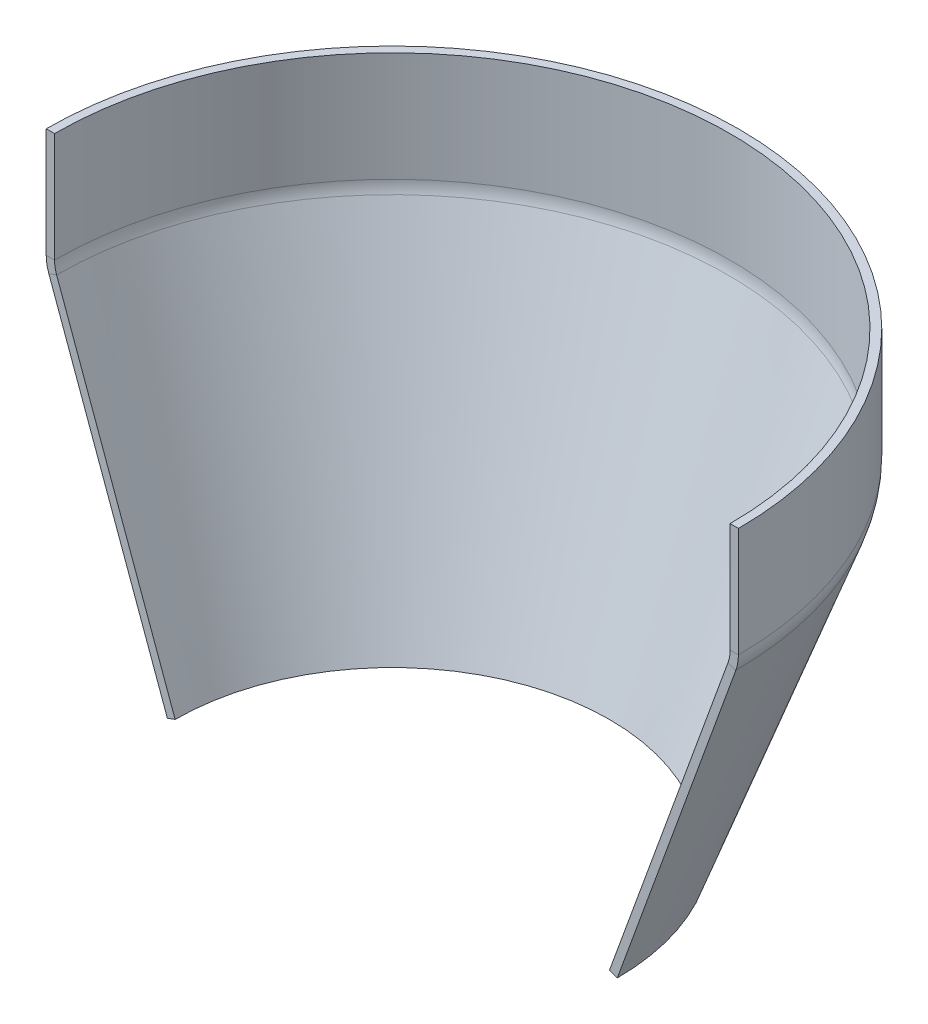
ISO-10303-21;
HEADER;
FILE_DESCRIPTION(('STEP AP214'),'2;1');
FILE_NAME('part.step','',(''),(''),'','','');
FILE_SCHEMA(('AUTOMOTIVE_DESIGN { 1 0 10303 214 1 1 1 1 }'));
ENDSEC;
DATA;
#1=APPLICATION_CONTEXT('core data for automotive mechanical design processes');
#2=APPLICATION_PROTOCOL_DEFINITION('international standard','automotive_design',2000,#1);
#3=PRODUCT_CONTEXT('',#1,'mechanical');
#4=PRODUCT('Part','Part','',(#3));
#5=PRODUCT_RELATED_PRODUCT_CATEGORY('part','',(#4));
#6=PRODUCT_DEFINITION_FORMATION('','',#4);
#7=PRODUCT_DEFINITION_CONTEXT('part definition',#1,'design');
#8=PRODUCT_DEFINITION('design','',#6,#7);
#9=PRODUCT_DEFINITION_SHAPE('','',#8);
#10=(LENGTH_UNIT() NAMED_UNIT(*) SI_UNIT(.MILLI.,.METRE.));
#11=(NAMED_UNIT(*) PLANE_ANGLE_UNIT() SI_UNIT($,.RADIAN.));
#12=(NAMED_UNIT(*) SI_UNIT($,.STERADIAN.) SOLID_ANGLE_UNIT());
#13=UNCERTAINTY_MEASURE_WITH_UNIT(LENGTH_MEASURE(1.E-05),#10,'distance_accuracy_value','');
#14=(GEOMETRIC_REPRESENTATION_CONTEXT(3) GLOBAL_UNCERTAINTY_ASSIGNED_CONTEXT((#13)) GLOBAL_UNIT_ASSIGNED_CONTEXT((#10,
#11,#12)) REPRESENTATION_CONTEXT('',''));
#15=CARTESIAN_POINT('',(0.,0.,0.));
#16=DIRECTION('',(0.,0.,1.));
#17=DIRECTION('',(1.,0.,0.));
#18=AXIS2_PLACEMENT_3D('',#15,#16,#17);
#19=CARTESIAN_POINT('',(-43.8,49.1740821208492,0.));
#20=DIRECTION('',(0.,0.,-1.));
#21=DIRECTION('',(-1.,0.,0.));
#22=AXIS2_PLACEMENT_3D('',#19,#20,#21);
#23=PLANE('',#22);
#24=DIRECTION('',(1.,0.,0.));
#25=VECTOR('',#24,1.);
#26=CARTESIAN_POINT('',(-50.,49.1740821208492,0.));
#27=LINE('',#26,#25);
#28=CARTESIAN_POINT('',(-50.,49.1740821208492,0.));
#29=VERTEX_POINT('',#28);
#30=CARTESIAN_POINT('',(-48.8,49.1740821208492,0.));
#31=VERTEX_POINT('',#30);
#32=EDGE_CURVE('E11',#29,#31,#27,.T.);
#33=ORIENTED_EDGE('',*,*,#32,.F.);
#34=CARTESIAN_POINT('',(-43.8,49.1740821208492,0.));
#35=DIRECTION('',(0.,0.,1.));
#36=DIRECTION('',(1.,0.,0.));
#37=AXIS2_PLACEMENT_3D('',#34,#35,#36);
#38=CIRCLE('',#37,6.2);
#39=CARTESIAN_POINT('',(-49.6260942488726,47.0535572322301,0.));
#40=VERTEX_POINT('',#39);
#41=EDGE_CURVE('E135',#40,#29,#38,.F.);
#42=ORIENTED_EDGE('',*,*,#41,.F.);
#43=DIRECTION('',(0.939692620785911,0.342020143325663,0.));
#44=VECTOR('',#43,1.);
#45=CARTESIAN_POINT('',(-49.6260942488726,47.0535572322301,0.));
#46=LINE('',#45,#44);
#47=CARTESIAN_POINT('',(-48.4984631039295,47.4639814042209,0.));
#48=VERTEX_POINT('',#47);
#49=EDGE_CURVE('E48',#40,#48,#46,.T.);
#50=ORIENTED_EDGE('',*,*,#49,.T.);
#51=CARTESIAN_POINT('',(-43.8,49.1740821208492,0.));
#52=DIRECTION('',(0.,0.,-1.));
#53=DIRECTION('',(-1.,0.,0.));
#54=AXIS2_PLACEMENT_3D('',#51,#52,#53);
#55=CIRCLE('',#54,5.);
#56=EDGE_CURVE('E132',#48,#31,#55,.T.);
#57=ORIENTED_EDGE('',*,*,#56,.T.);
#58=EDGE_LOOP('',(#33,#42,#50,#57));
#59=FACE_BOUND('',#58,.T.);
#60=ADVANCED_FACE('F38',(#59),#23,.F.);
#61=CARTESIAN_POINT('',(-32.5,0.,0.));
#62=DIRECTION('',(0.,0.,1.));
#63=DIRECTION('',(-0.342020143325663,0.93969262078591,0.));
#64=AXIS2_PLACEMENT_3D('',#61,#62,#63);
#65=PLANE('',#64);
#66=ORIENTED_EDGE('',*,*,#49,.F.);
#67=DIRECTION('',(-0.342020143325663,0.93969262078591,0.));
#68=VECTOR('',#67,1.);
#69=CARTESIAN_POINT('',(-32.5,0.,0.));
#70=LINE('',#69,#68);
#71=CARTESIAN_POINT('',(-32.5,0.,0.));
#72=VERTEX_POINT('',#71);
#73=EDGE_CURVE('E175',#72,#40,#70,.T.);
#74=ORIENTED_EDGE('',*,*,#73,.F.);
#75=DIRECTION('',(0.939692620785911,0.342020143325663,0.));
#76=VECTOR('',#75,1.);
#77=CARTESIAN_POINT('',(-32.5,0.,0.));
#78=LINE('',#77,#76);
#79=CARTESIAN_POINT('',(-31.3723688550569,0.410424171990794,0.));
#80=VERTEX_POINT('',#79);
#81=EDGE_CURVE('E124',#72,#80,#78,.T.);
#82=ORIENTED_EDGE('',*,*,#81,.T.);
#83=DIRECTION('',(-0.342020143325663,0.939692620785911,0.));
#84=VECTOR('',#83,1.);
#85=CARTESIAN_POINT('',(-31.3723688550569,0.410424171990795,0.));
#86=LINE('',#85,#84);
#87=EDGE_CURVE('E152',#80,#48,#86,.T.);
#88=ORIENTED_EDGE('',*,*,#87,.T.);
#89=EDGE_LOOP('',(#66,#74,#82,#88));
#90=FACE_BOUND('',#89,.T.);
#91=ADVANCED_FACE('F153',(#90),#65,.T.);
#92=CARTESIAN_POINT('',(0.,0.,0.));
#93=DIRECTION('',(0.,-1.,0.));
#94=DIRECTION('',(0.,0.,-1.));
#95=AXIS2_PLACEMENT_3D('',#92,#93,#94);
#96=CONICAL_SURFACE('',#95,32.5,1.22173047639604);
#97=ORIENTED_EDGE('',*,*,#81,.F.);
#98=CARTESIAN_POINT('',(0.,0.,0.));
#99=DIRECTION('',(0.,1.,0.));
#100=DIRECTION('',(1.,0.,0.));
#101=AXIS2_PLACEMENT_3D('',#98,#99,#100);
#102=CIRCLE('',#101,32.5);
#103=CARTESIAN_POINT('',(32.5,0.,0.));
#104=VERTEX_POINT('',#103);
#105=EDGE_CURVE('E102',#104,#72,#102,.T.);
#106=ORIENTED_EDGE('',*,*,#105,.F.);
#107=DIRECTION('',(-0.939692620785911,0.342020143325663,0.));
#108=VECTOR('',#107,1.);
#109=CARTESIAN_POINT('',(32.5,0.,0.));
#110=LINE('',#109,#108);
#111=CARTESIAN_POINT('',(31.3723688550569,0.410424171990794,0.));
#112=VERTEX_POINT('',#111);
#113=EDGE_CURVE('E121',#104,#112,#110,.T.);
#114=ORIENTED_EDGE('',*,*,#113,.T.);
#115=CARTESIAN_POINT('',(0.,0.410424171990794,0.));
#116=DIRECTION('',(0.,1.,0.));
#117=DIRECTION('',(0.,0.,1.));
#118=AXIS2_PLACEMENT_3D('',#115,#116,#117);
#119=CIRCLE('',#118,31.3723688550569);
#120=EDGE_CURVE('E157',#112,#80,#119,.T.);
#121=ORIENTED_EDGE('',*,*,#120,.T.);
#122=EDGE_LOOP('',(#97,#106,#114,#121));
#123=FACE_BOUND('',#122,.T.);
#124=ADVANCED_FACE('F214',(#123),#96,.F.);
#125=CARTESIAN_POINT('',(32.5,0.,0.));
#126=DIRECTION('',(0.,0.,-1.));
#127=DIRECTION('',(0.342020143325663,0.93969262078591,0.));
#128=AXIS2_PLACEMENT_3D('',#125,#126,#127);
#129=PLANE('',#128);
#130=ORIENTED_EDGE('',*,*,#113,.F.);
#131=DIRECTION('',(0.342020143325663,0.93969262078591,0.));
#132=VECTOR('',#131,1.);
#133=CARTESIAN_POINT('',(32.5,0.,0.));
#134=LINE('',#133,#132);
#135=CARTESIAN_POINT('',(49.6260942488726,47.0535572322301,0.));
#136=VERTEX_POINT('',#135);
#137=EDGE_CURVE('E172',#104,#136,#134,.T.);
#138=ORIENTED_EDGE('',*,*,#137,.T.);
#139=DIRECTION('',(-0.939692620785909,0.342020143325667,0.));
#140=VECTOR('',#139,1.);
#141=CARTESIAN_POINT('',(49.6260942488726,47.0535572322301,0.));
#142=LINE('',#141,#140);
#143=CARTESIAN_POINT('',(48.4984631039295,47.4639814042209,0.));
#144=VERTEX_POINT('',#143);
#145=EDGE_CURVE('E118',#136,#144,#142,.T.);
#146=ORIENTED_EDGE('',*,*,#145,.T.);
#147=DIRECTION('',(0.342020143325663,0.939692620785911,0.));
#148=VECTOR('',#147,1.);
#149=CARTESIAN_POINT('',(31.3723688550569,0.410424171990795,0.));
#150=LINE('',#149,#148);
#151=EDGE_CURVE('E109',#112,#144,#150,.T.);
#152=ORIENTED_EDGE('',*,*,#151,.F.);
#153=EDGE_LOOP('',(#130,#138,#146,#152));
#154=FACE_BOUND('',#153,.T.);
#155=ADVANCED_FACE('F219',(#154),#129,.F.);
#156=CARTESIAN_POINT('',(43.8,49.1740821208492,0.));
#157=DIRECTION('',(0.,0.,1.));
#158=DIRECTION('',(1.,0.,0.));
#159=AXIS2_PLACEMENT_3D('',#156,#157,#158);
#160=PLANE('',#159);
#161=ORIENTED_EDGE('',*,*,#145,.F.);
#162=CARTESIAN_POINT('',(43.8,49.1740821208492,0.));
#163=DIRECTION('',(0.,0.,-1.));
#164=DIRECTION('',(-1.,0.,0.));
#165=AXIS2_PLACEMENT_3D('',#162,#163,#164);
#166=CIRCLE('',#165,6.2);
#167=CARTESIAN_POINT('',(50.,49.1740821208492,0.));
#168=VERTEX_POINT('',#167);
#169=EDGE_CURVE('E103',#136,#168,#166,.F.);
#170=ORIENTED_EDGE('',*,*,#169,.T.);
#171=DIRECTION('',(-1.,0.,0.));
#172=VECTOR('',#171,1.);
#173=CARTESIAN_POINT('',(50.,49.1740821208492,0.));
#174=LINE('',#173,#172);
#175=CARTESIAN_POINT('',(48.8,49.1740821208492,0.));
#176=VERTEX_POINT('',#175);
#177=EDGE_CURVE('E92',#168,#176,#174,.T.);
#178=ORIENTED_EDGE('',*,*,#177,.T.);
#179=CARTESIAN_POINT('',(43.8,49.1740821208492,0.));
#180=DIRECTION('',(0.,0.,1.));
#181=DIRECTION('',(1.,0.,0.));
#182=AXIS2_PLACEMENT_3D('',#179,#180,#181);
#183=CIRCLE('',#182,5.);
#184=EDGE_CURVE('E112',#144,#176,#183,.T.);
#185=ORIENTED_EDGE('',*,*,#184,.F.);
#186=EDGE_LOOP('',(#161,#170,#178,#185));
#187=FACE_BOUND('',#186,.T.);
#188=ADVANCED_FACE('F200',(#187),#160,.T.);
#189=CARTESIAN_POINT('',(50.,57.0870410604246,0.));
#190=DIRECTION('',(0.,0.,-1.));
#191=DIRECTION('',(0.,1.,0.));
#192=AXIS2_PLACEMENT_3D('',#189,#190,#191);
#193=PLANE('',#192);
#194=ORIENTED_EDGE('',*,*,#177,.F.);
#195=DIRECTION('',(0.,1.,0.));
#196=VECTOR('',#195,1.);
#197=CARTESIAN_POINT('',(50.,48.0808548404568,0.));
#198=LINE('',#197,#196);
#199=CARTESIAN_POINT('',(50.,65.,0.));
#200=VERTEX_POINT('',#199);
#201=EDGE_CURVE('E95',#168,#200,#198,.T.);
#202=ORIENTED_EDGE('',*,*,#201,.T.);
#203=DIRECTION('',(-1.,0.,0.));
#204=VECTOR('',#203,1.);
#205=CARTESIAN_POINT('',(50.,65.,0.));
#206=LINE('',#205,#204);
#207=CARTESIAN_POINT('',(48.8,65.,0.));
#208=VERTEX_POINT('',#207);
#209=EDGE_CURVE('E81',#200,#208,#206,.T.);
#210=ORIENTED_EDGE('',*,*,#209,.T.);
#211=DIRECTION('',(0.,1.,0.));
#212=VECTOR('',#211,1.);
#213=CARTESIAN_POINT('',(48.8,0.,0.));
#214=LINE('',#213,#212);
#215=EDGE_CURVE('E167',#176,#208,#214,.T.);
#216=ORIENTED_EDGE('',*,*,#215,.F.);
#217=EDGE_LOOP('',(#194,#202,#210,#216));
#218=FACE_BOUND('',#217,.T.);
#219=ADVANCED_FACE('F96',(#218),#193,.F.);
#220=CARTESIAN_POINT('',(0.,65.,0.));
#221=DIRECTION('',(0.,-1.,0.));
#222=DIRECTION('',(0.,0.,-1.));
#223=AXIS2_PLACEMENT_3D('',#220,#221,#222);
#224=PLANE('',#223);
#225=ORIENTED_EDGE('',*,*,#209,.F.);
#226=CARTESIAN_POINT('',(0.,65.,0.));
#227=DIRECTION('',(0.,1.,0.));
#228=DIRECTION('',(1.,0.,0.));
#229=AXIS2_PLACEMENT_3D('',#226,#227,#228);
#230=CIRCLE('',#229,50.);
#231=CARTESIAN_POINT('',(-50.,65.,0.));
#232=VERTEX_POINT('',#231);
#233=EDGE_CURVE('E85',#200,#232,#230,.T.);
#234=ORIENTED_EDGE('',*,*,#233,.T.);
#235=DIRECTION('',(1.,0.,0.));
#236=VECTOR('',#235,1.);
#237=CARTESIAN_POINT('',(-50.,65.,0.));
#238=LINE('',#237,#236);
#239=CARTESIAN_POINT('',(-48.8,65.,0.));
#240=VERTEX_POINT('',#239);
#241=EDGE_CURVE('E42',#232,#240,#238,.T.);
#242=ORIENTED_EDGE('',*,*,#241,.T.);
#243=CARTESIAN_POINT('',(0.,65.,0.));
#244=DIRECTION('',(0.,1.,0.));
#245=DIRECTION('',(0.,0.,1.));
#246=AXIS2_PLACEMENT_3D('',#243,#244,#245);
#247=CIRCLE('',#246,48.8);
#248=EDGE_CURVE('E88',#208,#240,#247,.T.);
#249=ORIENTED_EDGE('',*,*,#248,.F.);
#250=EDGE_LOOP('',(#225,#234,#242,#249));
#251=FACE_BOUND('',#250,.T.);
#252=ADVANCED_FACE('F83',(#251),#224,.F.);
#253=CARTESIAN_POINT('',(-50.,57.0870410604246,0.));
#254=DIRECTION('',(0.,0.,1.));
#255=DIRECTION('',(0.,1.,0.));
#256=AXIS2_PLACEMENT_3D('',#253,#254,#255);
#257=PLANE('',#256);
#258=DIRECTION('',(0.,1.,0.));
#259=VECTOR('',#258,1.);
#260=CARTESIAN_POINT('',(-50.,48.0808548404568,0.));
#261=LINE('',#260,#259);
#262=EDGE_CURVE('E108',#29,#232,#261,.T.);
#263=ORIENTED_EDGE('',*,*,#262,.F.);
#264=ORIENTED_EDGE('',*,*,#32,.T.);
#265=DIRECTION('',(0.,1.,0.));
#266=VECTOR('',#265,1.);
#267=CARTESIAN_POINT('',(-48.8,0.,0.));
#268=LINE('',#267,#266);
#269=EDGE_CURVE('E166',#31,#240,#268,.T.);
#270=ORIENTED_EDGE('',*,*,#269,.T.);
#271=ORIENTED_EDGE('',*,*,#241,.F.);
#272=EDGE_LOOP('',(#263,#264,#270,#271));
#273=FACE_BOUND('',#272,.T.);
#274=ADVANCED_FACE('F40',(#273),#257,.T.);
#275=CARTESIAN_POINT('',(0.,0.,0.));
#276=DIRECTION('',(0.,1.,0.));
#277=DIRECTION('',(0.,0.,1.));
#278=AXIS2_PLACEMENT_3D('',#275,#276,#277);
#279=CYLINDRICAL_SURFACE('',#278,48.8);
#280=ORIENTED_EDGE('',*,*,#248,.T.);
#281=ORIENTED_EDGE('',*,*,#269,.F.);
#282=CARTESIAN_POINT('',(0.,49.1740821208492,0.));
#283=DIRECTION('',(0.,1.,0.));
#284=DIRECTION('',(0.,0.,1.));
#285=AXIS2_PLACEMENT_3D('',#282,#283,#284);
#286=CIRCLE('',#285,48.8);
#287=EDGE_CURVE('E149',#176,#31,#286,.T.);
#288=ORIENTED_EDGE('',*,*,#287,.F.);
#289=ORIENTED_EDGE('',*,*,#215,.T.);
#290=EDGE_LOOP('',(#280,#281,#288,#289));
#291=FACE_BOUND('',#290,.T.);
#292=ADVANCED_FACE('F202',(#291),#279,.F.);
#293=CARTESIAN_POINT('',(0.,49.1740821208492,0.));
#294=DIRECTION('',(0.,1.,0.));
#295=DIRECTION('',(0.,0.,1.));
#296=AXIS2_PLACEMENT_3D('',#293,#294,#295);
#297=TOROIDAL_SURFACE('',#296,43.8,5.);
#298=ORIENTED_EDGE('',*,*,#287,.T.);
#299=ORIENTED_EDGE('',*,*,#56,.F.);
#300=CARTESIAN_POINT('',(0.,47.4639814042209,0.));
#301=DIRECTION('',(0.,1.,0.));
#302=DIRECTION('',(0.,0.,1.));
#303=AXIS2_PLACEMENT_3D('',#300,#301,#302);
#304=CIRCLE('',#303,48.4984631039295);
#305=EDGE_CURVE('E147',#144,#48,#304,.T.);
#306=ORIENTED_EDGE('',*,*,#305,.F.);
#307=ORIENTED_EDGE('',*,*,#184,.T.);
#308=EDGE_LOOP('',(#298,#299,#306,#307));
#309=FACE_BOUND('',#308,.T.);
#310=ADVANCED_FACE('F143',(#309),#297,.F.);
#311=CARTESIAN_POINT('',(0.,0.410424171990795,0.));
#312=DIRECTION('',(0.,1.,0.));
#313=DIRECTION('',(0.,0.,1.));
#314=AXIS2_PLACEMENT_3D('',#311,#312,#313);
#315=CONICAL_SURFACE('',#314,31.3723688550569,0.34906585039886);
#316=ORIENTED_EDGE('',*,*,#305,.T.);
#317=ORIENTED_EDGE('',*,*,#87,.F.);
#318=ORIENTED_EDGE('',*,*,#120,.F.);
#319=ORIENTED_EDGE('',*,*,#151,.T.);
#320=EDGE_LOOP('',(#316,#317,#318,#319));
#321=FACE_BOUND('',#320,.T.);
#322=ADVANCED_FACE('F159',(#321),#315,.F.);
#323=CARTESIAN_POINT('',(0.,0.,0.));
#324=DIRECTION('',(0.,1.,0.));
#325=DIRECTION('',(0.,0.,1.));
#326=AXIS2_PLACEMENT_3D('',#323,#324,#325);
#327=CYLINDRICAL_SURFACE('',#326,50.);
#328=ORIENTED_EDGE('',*,*,#233,.F.);
#329=ORIENTED_EDGE('',*,*,#201,.F.);
#330=CARTESIAN_POINT('',(0.,49.1740821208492,0.));
#331=DIRECTION('',(0.,1.,0.));
#332=DIRECTION('',(1.,0.,0.));
#333=AXIS2_PLACEMENT_3D('',#330,#331,#332);
#334=CIRCLE('',#333,50.);
#335=EDGE_CURVE('E114',#168,#29,#334,.T.);
#336=ORIENTED_EDGE('',*,*,#335,.T.);
#337=ORIENTED_EDGE('',*,*,#262,.T.);
#338=EDGE_LOOP('',(#328,#329,#336,#337));
#339=FACE_BOUND('',#338,.T.);
#340=ADVANCED_FACE('F106',(#339),#327,.T.);
#341=CARTESIAN_POINT('',(0.,49.1740821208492,0.));
#342=DIRECTION('',(0.,1.,0.));
#343=DIRECTION('',(0.,0.,1.));
#344=AXIS2_PLACEMENT_3D('',#341,#342,#343);
#345=TOROIDAL_SURFACE('',#344,43.8,6.2);
#346=ORIENTED_EDGE('',*,*,#335,.F.);
#347=ORIENTED_EDGE('',*,*,#169,.F.);
#348=CARTESIAN_POINT('',(0.,47.0535572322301,0.));
#349=DIRECTION('',(0.,1.,0.));
#350=DIRECTION('',(1.,0.,0.));
#351=AXIS2_PLACEMENT_3D('',#348,#349,#350);
#352=CIRCLE('',#351,49.6260942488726);
#353=EDGE_CURVE('E178',#136,#40,#352,.T.);
#354=ORIENTED_EDGE('',*,*,#353,.T.);
#355=ORIENTED_EDGE('',*,*,#41,.T.);
#356=EDGE_LOOP('',(#346,#347,#354,#355));
#357=FACE_BOUND('',#356,.T.);
#358=ADVANCED_FACE('F186',(#357),#345,.T.);
#359=CARTESIAN_POINT('',(0.,0.,0.));
#360=DIRECTION('',(0.,1.,0.));
#361=DIRECTION('',(0.,0.,1.));
#362=AXIS2_PLACEMENT_3D('',#359,#360,#361);
#363=CONICAL_SURFACE('',#362,32.5,0.34906585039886);
#364=ORIENTED_EDGE('',*,*,#353,.F.);
#365=ORIENTED_EDGE('',*,*,#137,.F.);
#366=ORIENTED_EDGE('',*,*,#105,.T.);
#367=ORIENTED_EDGE('',*,*,#73,.T.);
#368=EDGE_LOOP('',(#364,#365,#366,#367));
#369=FACE_BOUND('',#368,.T.);
#370=ADVANCED_FACE('F233',(#369),#363,.T.);
#371=CLOSED_SHELL('',(#60,#91,#124,#155,#188,#219,#252,#274,#292,#310,#322,#340,#358,#370));
#372=MANIFOLD_SOLID_BREP('B2',#371);
#373=ADVANCED_BREP_SHAPE_REPRESENTATION('',(#18,#372),#14);
#374=SHAPE_DEFINITION_REPRESENTATION(#9,#373);
ENDSEC;
END-ISO-10303-21;
